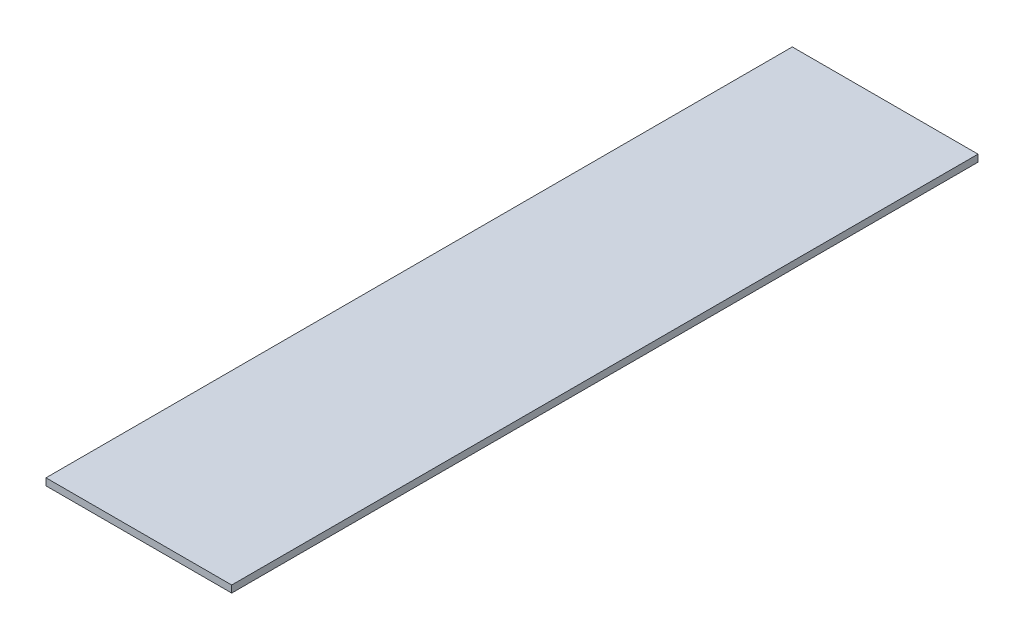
ISO-10303-21;
HEADER;
FILE_DESCRIPTION(('STEP AP214'),'2;1');
FILE_NAME('part.step','',(''),(''),'','','');
FILE_SCHEMA(('AUTOMOTIVE_DESIGN { 1 0 10303 214 1 1 1 1 }'));
ENDSEC;
DATA;
#1=APPLICATION_CONTEXT('core data for automotive mechanical design processes');
#2=APPLICATION_PROTOCOL_DEFINITION('international standard','automotive_design',2000,#1);
#3=PRODUCT_CONTEXT('',#1,'mechanical');
#4=PRODUCT('Part','Part','',(#3));
#5=PRODUCT_RELATED_PRODUCT_CATEGORY('part','',(#4));
#6=PRODUCT_DEFINITION_FORMATION('','',#4);
#7=PRODUCT_DEFINITION_CONTEXT('part definition',#1,'design');
#8=PRODUCT_DEFINITION('design','',#6,#7);
#9=PRODUCT_DEFINITION_SHAPE('','',#8);
#10=(LENGTH_UNIT() NAMED_UNIT(*) SI_UNIT(.MILLI.,.METRE.));
#11=(NAMED_UNIT(*) PLANE_ANGLE_UNIT() SI_UNIT($,.RADIAN.));
#12=(NAMED_UNIT(*) SI_UNIT($,.STERADIAN.) SOLID_ANGLE_UNIT());
#13=UNCERTAINTY_MEASURE_WITH_UNIT(LENGTH_MEASURE(1.E-05),#10,'distance_accuracy_value','');
#14=(GEOMETRIC_REPRESENTATION_CONTEXT(3) GLOBAL_UNCERTAINTY_ASSIGNED_CONTEXT((#13)) GLOBAL_UNIT_ASSIGNED_CONTEXT((#10,
#11,#12)) REPRESENTATION_CONTEXT('',''));
#15=CARTESIAN_POINT('',(0.,0.,0.));
#16=DIRECTION('',(0.,0.,1.));
#17=DIRECTION('',(1.,0.,0.));
#18=AXIS2_PLACEMENT_3D('',#15,#16,#17);
#19=CARTESIAN_POINT('',(265.,-10.,1065.));
#20=DIRECTION('',(-1.,0.,0.));
#21=DIRECTION('',(0.,0.,1.));
#22=AXIS2_PLACEMENT_3D('',#19,#20,#21);
#23=PLANE('',#22);
#24=DIRECTION('',(0.,1.,0.));
#25=VECTOR('',#24,1.);
#26=CARTESIAN_POINT('',(265.,-10.,-1065.));
#27=LINE('',#26,#25);
#28=CARTESIAN_POINT('',(265.,-10.,-1065.));
#29=VERTEX_POINT('',#28);
#30=CARTESIAN_POINT('',(265.,10.,-1065.));
#31=VERTEX_POINT('',#30);
#32=EDGE_CURVE('E104',#29,#31,#27,.T.);
#33=ORIENTED_EDGE('',*,*,#32,.T.);
#34=DIRECTION('',(0.,0.,-1.));
#35=VECTOR('',#34,1.);
#36=CARTESIAN_POINT('',(265.,10.,1065.));
#37=LINE('',#36,#35);
#38=CARTESIAN_POINT('',(265.,10.,1065.));
#39=VERTEX_POINT('',#38);
#40=EDGE_CURVE('E11',#39,#31,#37,.T.);
#41=ORIENTED_EDGE('',*,*,#40,.F.);
#42=DIRECTION('',(0.,1.,0.));
#43=VECTOR('',#42,1.);
#44=CARTESIAN_POINT('',(265.,-10.,1065.));
#45=LINE('',#44,#43);
#46=CARTESIAN_POINT('',(265.,-10.,1065.));
#47=VERTEX_POINT('',#46);
#48=EDGE_CURVE('E92',#47,#39,#45,.T.);
#49=ORIENTED_EDGE('',*,*,#48,.F.);
#50=DIRECTION('',(0.,0.,-1.));
#51=VECTOR('',#50,1.);
#52=CARTESIAN_POINT('',(265.,-10.,1065.));
#53=LINE('',#52,#51);
#54=EDGE_CURVE('E100',#47,#29,#53,.T.);
#55=ORIENTED_EDGE('',*,*,#54,.T.);
#56=EDGE_LOOP('',(#33,#41,#49,#55));
#57=FACE_BOUND('',#56,.T.);
#58=ADVANCED_FACE('F41',(#57),#23,.F.);
#59=CARTESIAN_POINT('',(-265.,10.,1065.));
#60=DIRECTION('',(0.,-1.,0.));
#61=DIRECTION('',(0.,0.,-1.));
#62=AXIS2_PLACEMENT_3D('',#59,#60,#61);
#63=PLANE('',#62);
#64=DIRECTION('',(-1.,0.,0.));
#65=VECTOR('',#64,1.);
#66=CARTESIAN_POINT('',(-265.,10.,-1065.));
#67=LINE('',#66,#65);
#68=CARTESIAN_POINT('',(-265.,10.,-1065.));
#69=VERTEX_POINT('',#68);
#70=EDGE_CURVE('E96',#31,#69,#67,.T.);
#71=ORIENTED_EDGE('',*,*,#70,.T.);
#72=DIRECTION('',(0.,0.,-1.));
#73=VECTOR('',#72,1.);
#74=CARTESIAN_POINT('',(-265.,10.,1065.));
#75=LINE('',#74,#73);
#76=CARTESIAN_POINT('',(-265.,10.,1065.));
#77=VERTEX_POINT('',#76);
#78=EDGE_CURVE('E49',#77,#69,#75,.T.);
#79=ORIENTED_EDGE('',*,*,#78,.F.);
#80=DIRECTION('',(-1.,0.,0.));
#81=VECTOR('',#80,1.);
#82=CARTESIAN_POINT('',(-265.,10.,1065.));
#83=LINE('',#82,#81);
#84=EDGE_CURVE('E87',#39,#77,#83,.T.);
#85=ORIENTED_EDGE('',*,*,#84,.F.);
#86=ORIENTED_EDGE('',*,*,#40,.T.);
#87=EDGE_LOOP('',(#71,#79,#85,#86));
#88=FACE_BOUND('',#87,.T.);
#89=ADVANCED_FACE('F95',(#88),#63,.F.);
#90=CARTESIAN_POINT('',(-265.,-10.,1065.));
#91=DIRECTION('',(1.,0.,0.));
#92=DIRECTION('',(0.,0.,-1.));
#93=AXIS2_PLACEMENT_3D('',#90,#91,#92);
#94=PLANE('',#93);
#95=DIRECTION('',(0.,-1.,0.));
#96=VECTOR('',#95,1.);
#97=CARTESIAN_POINT('',(-265.,-10.,-1065.));
#98=LINE('',#97,#96);
#99=CARTESIAN_POINT('',(-265.,-10.,-1065.));
#100=VERTEX_POINT('',#99);
#101=EDGE_CURVE('E74',#69,#100,#98,.T.);
#102=ORIENTED_EDGE('',*,*,#101,.T.);
#103=DIRECTION('',(0.,0.,-1.));
#104=VECTOR('',#103,1.);
#105=CARTESIAN_POINT('',(-265.,-10.,1065.));
#106=LINE('',#105,#104);
#107=CARTESIAN_POINT('',(-265.,-10.,1065.));
#108=VERTEX_POINT('',#107);
#109=EDGE_CURVE('E97',#108,#100,#106,.T.);
#110=ORIENTED_EDGE('',*,*,#109,.F.);
#111=DIRECTION('',(0.,-1.,0.));
#112=VECTOR('',#111,1.);
#113=CARTESIAN_POINT('',(-265.,-10.,1065.));
#114=LINE('',#113,#112);
#115=EDGE_CURVE('E90',#77,#108,#114,.T.);
#116=ORIENTED_EDGE('',*,*,#115,.F.);
#117=ORIENTED_EDGE('',*,*,#78,.T.);
#118=EDGE_LOOP('',(#102,#110,#116,#117));
#119=FACE_BOUND('',#118,.T.);
#120=ADVANCED_FACE('F98',(#119),#94,.F.);
#121=CARTESIAN_POINT('',(-265.,-10.,1065.));
#122=DIRECTION('',(0.,1.,0.));
#123=DIRECTION('',(0.,0.,1.));
#124=AXIS2_PLACEMENT_3D('',#121,#122,#123);
#125=PLANE('',#124);
#126=DIRECTION('',(1.,0.,0.));
#127=VECTOR('',#126,1.);
#128=CARTESIAN_POINT('',(-265.,-10.,-1065.));
#129=LINE('',#128,#127);
#130=EDGE_CURVE('E80',#100,#29,#129,.T.);
#131=ORIENTED_EDGE('',*,*,#130,.T.);
#132=ORIENTED_EDGE('',*,*,#54,.F.);
#133=DIRECTION('',(1.,0.,0.));
#134=VECTOR('',#133,1.);
#135=CARTESIAN_POINT('',(-265.,-10.,1065.));
#136=LINE('',#135,#134);
#137=EDGE_CURVE('E57',#108,#47,#136,.T.);
#138=ORIENTED_EDGE('',*,*,#137,.F.);
#139=ORIENTED_EDGE('',*,*,#109,.T.);
#140=EDGE_LOOP('',(#131,#132,#138,#139));
#141=FACE_BOUND('',#140,.T.);
#142=ADVANCED_FACE('F111',(#141),#125,.F.);
#143=CARTESIAN_POINT('',(0.,0.,1065.));
#144=DIRECTION('',(0.,0.,-1.));
#145=DIRECTION('',(-1.,0.,0.));
#146=AXIS2_PLACEMENT_3D('',#143,#144,#145);
#147=PLANE('',#146);
#148=ORIENTED_EDGE('',*,*,#48,.T.);
#149=ORIENTED_EDGE('',*,*,#84,.T.);
#150=ORIENTED_EDGE('',*,*,#115,.T.);
#151=ORIENTED_EDGE('',*,*,#137,.T.);
#152=EDGE_LOOP('',(#148,#149,#150,#151));
#153=FACE_BOUND('',#152,.T.);
#154=ADVANCED_FACE('F88',(#153),#147,.F.);
#155=CARTESIAN_POINT('',(0.,0.,-1065.));
#156=DIRECTION('',(0.,0.,-1.));
#157=DIRECTION('',(-1.,0.,0.));
#158=AXIS2_PLACEMENT_3D('',#155,#156,#157);
#159=PLANE('',#158);
#160=ORIENTED_EDGE('',*,*,#32,.F.);
#161=ORIENTED_EDGE('',*,*,#130,.F.);
#162=ORIENTED_EDGE('',*,*,#101,.F.);
#163=ORIENTED_EDGE('',*,*,#70,.F.);
#164=EDGE_LOOP('',(#160,#161,#162,#163));
#165=FACE_BOUND('',#164,.T.);
#166=ADVANCED_FACE('F114',(#165),#159,.T.);
#167=CLOSED_SHELL('',(#58,#89,#120,#142,#154,#166));
#168=MANIFOLD_SOLID_BREP('B2',#167);
#169=ADVANCED_BREP_SHAPE_REPRESENTATION('',(#18,#168),#14);
#170=SHAPE_DEFINITION_REPRESENTATION(#9,#169);
ENDSEC;
END-ISO-10303-21;
